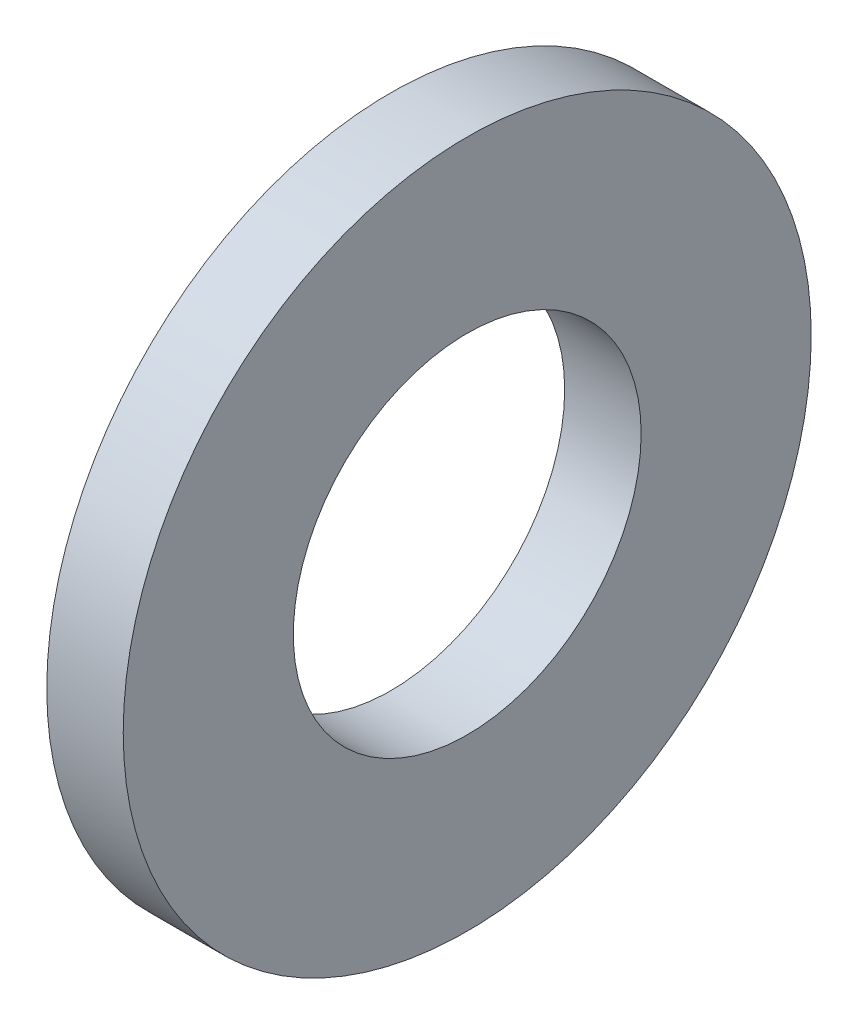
from build123d import *

# Parameters (mm, degrees)
SKETCH1_R          = 4.5
SKETCH1_R_2        = 2.275
BASE_EXTRUDE_DEPTH = 1


with BuildPart() as part:
    # Sketch1 → Base-Extrude (new body)
    with BuildSketch(Plane(origin=(0, 0, 0), x_dir=(0, 0, -1), z_dir=(1, 0, 0))):
        Circle(SKETCH1_R)
        Circle(SKETCH1_R_2, mode=Mode.SUBTRACT)
    extrude(amount=BASE_EXTRUDE_DEPTH)


solid = part.part
